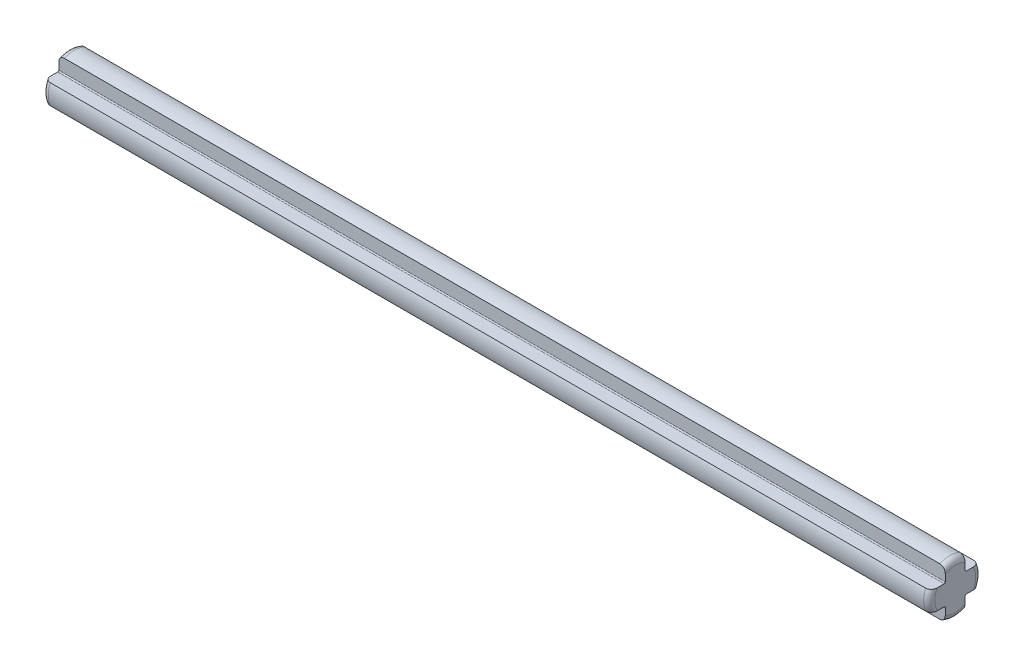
from build123d import *

# Parameters (mm, degrees)
EXTRUIR1_DEPTH = 40
REDONDEO1_R    = 0.5


with BuildPart() as part:
    # Croquis1 → Extruir1 (new, symmetric)
    with BuildSketch(Plane(origin=(0, 0, 0), x_dir=(0, 0, -1), z_dir=(1, 0, 0))):
        with BuildLine():
            Line((-0.9, 2.170829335), (-0.9, 1))
            ThreePointArc((-0.9, 1), (-0.929289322, 0.929289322), (-1, 0.9))
            Line((-1, 0.9), (-2.170829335, 0.9))
            ThreePointArc((-2.170829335, 0.9), (-2.35, 0), (-2.170829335, -0.9))
            Line((-2.170829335, -0.9), (-1, -0.9))
            ThreePointArc((-1, -0.9), (-0.929289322, -0.929289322), (-0.9, -1))
            Line((-0.9, -1), (-0.9, -2.170829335))
            ThreePointArc((-0.9, -2.170829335), (0, -2.35), (0.9, -2.170829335))
            Line((0.9, -2.170829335), (0.9, -1))
            ThreePointArc((0.9, -1), (0.929289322, -0.929289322), (1, -0.9))
            Line((1, -0.9), (2.170829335, -0.9))
            ThreePointArc((2.170829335, -0.9), (2.35, 0), (2.170829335, 0.9))
            Line((2.170829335, 0.9), (1, 0.9))
            ThreePointArc((1, 0.9), (0.929289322, 0.929289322), (0.9, 1))
            Line((0.9, 1), (0.9, 2.170829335))
            ThreePointArc((0.9, 2.170829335), (0, 2.35), (-0.9, 2.170829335))
        make_face()
    extrude(amount=EXTRUIR1_DEPTH, both=True)

    # Redondeo1
    redondeo1_edges = [part.edges().sort_by_distance(p)[0] for p in [
        (-40, 2.35, 0),
        (40, -2.35, 0),
        (-40, 0, -2.35),
        (-40, -2.35, 0),
        (-40, 0, 2.35),
        (40, 0, -2.35),
        (40, 0, 2.35),
        (40, 2.35, 0),
    ]]
    fillet(redondeo1_edges, radius=REDONDEO1_R)


solid = part.part
